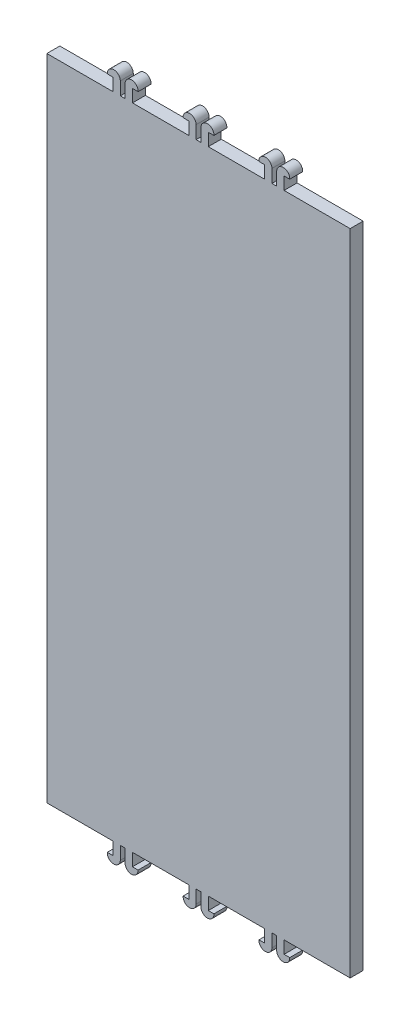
from build123d import *

# Parameters (mm, degrees)
BOSS_EXTRUDE1_DEPTH = 3


with BuildPart() as part:
    # Sketch1 → Boss-Extrude1 (new body)
    with BuildSketch(Plane.XY):
        with BuildLine():
            Line((35.05, -112.5), (35.05, 37.5))
            Line((35.05, 37.5), (19.774, 37.5))
            Line((19.774, 37.5), (19.774, 40.4))
            Line((19.774, 40.4), (21.07867185, 40.4))
            ThreePointArc((21.07867185, 40.4), (19.628027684, 42.003167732), (18.074, 40.5))
            Line((18.074, 40.5), (18.074, 37.5))
            Line((18.074, 37.5), (16.966, 37.5))
            Line((16.966, 37.5), (16.966, 40.5))
            ThreePointArc((16.966, 40.5), (15.411972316, 42.003167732), (13.96132815, 40.4))
            Line((13.96132815, 40.4), (15.266, 40.4))
            Line((15.266, 40.4), (15.266, 37.5))
            Line((15.266, 37.5), (2.254, 37.5))
            Line((2.254, 37.5), (2.254, 40.4))
            Line((2.254, 40.4), (3.55867185, 40.4))
            ThreePointArc((3.55867185, 40.4), (2.108027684, 42.003167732), (0.554, 40.5))
            Line((0.554, 40.5), (0.554, 37.5))
            Line((0.554, 37.5), (-0.554, 37.5))
            Line((-0.554, 37.5), (-0.554, 40.5))
            ThreePointArc((-0.554, 40.5), (-2.108027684, 42.003167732), (-3.55867185, 40.4))
            Line((-3.55867185, 40.4), (-2.254, 40.4))
            Line((-2.254, 40.4), (-2.254, 37.5))
            Line((-2.254, 37.5), (-15.271, 37.5))
            Line((-15.271, 37.5), (-15.271, 40.4))
            Line((-15.271, 40.4), (-13.96632815, 40.4))
            ThreePointArc((-13.96632815, 40.4), (-15.416972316, 42.003167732), (-16.971, 40.5))
            Line((-16.971, 40.5), (-16.971, 37.5))
            Line((-16.971, 37.5), (-18.079, 37.5))
            Line((-18.079, 37.5), (-18.079, 40.5))
            ThreePointArc((-18.079, 40.5), (-19.633027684, 42.003167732), (-21.08367185, 40.4))
            Line((-21.08367185, 40.4), (-19.779, 40.4))
            Line((-19.779, 40.4), (-19.779, 37.5))
            Line((-19.779, 37.5), (-35.05, 37.5))
            Line((-35.05, 37.5), (-35.05, -112.5))
            Line((-35.05, -112.5), (-19.779, -112.5))
            Line((-19.779, -112.5), (-19.779, -115.4))
            Line((-19.779, -115.4), (-21.08367185, -115.4))
            ThreePointArc((-21.08367185, -115.4), (-19.633027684, -117.003167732), (-18.079, -115.5))
            Line((-18.079, -115.5), (-18.079, -112.5))
            Line((-18.079, -112.5), (-16.971, -112.5))
            Line((-16.971, -112.5), (-16.971, -115.5))
            ThreePointArc((-16.971, -115.5), (-15.416972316, -117.003167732), (-13.96632815, -115.4))
            Line((-13.96632815, -115.4), (-15.271, -115.4))
            Line((-15.271, -115.4), (-15.271, -112.5))
            Line((-15.271, -112.5), (-2.254, -112.5))
            Line((-2.254, -112.5), (-2.254, -115.4))
            Line((-2.254, -115.4), (-3.55867185, -115.4))
            ThreePointArc((-3.55867185, -115.4), (-2.108027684, -117.003167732), (-0.554, -115.5))
            Line((-0.554, -115.5), (-0.554, -112.5))
            Line((-0.554, -112.5), (0.554, -112.5))
            Line((0.554, -112.5), (0.554, -115.5))
            ThreePointArc((0.554, -115.5), (2.108027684, -117.003167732), (3.55867185, -115.4))
            Line((3.55867185, -115.4), (2.254, -115.4))
            Line((2.254, -115.4), (2.254, -112.5))
            Line((2.254, -112.5), (15.266, -112.5))
            Line((15.266, -112.5), (15.266, -115.4))
            Line((15.266, -115.4), (13.96132815, -115.4))
            ThreePointArc((13.96132815, -115.4), (15.411972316, -117.003167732), (16.966, -115.5))
            Line((16.966, -115.5), (16.966, -112.5))
            Line((16.966, -112.5), (18.074, -112.5))
            Line((18.074, -112.5), (18.074, -115.5))
            ThreePointArc((18.074, -115.5), (19.628027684, -117.003167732), (21.07867185, -115.4))
            Line((21.07867185, -115.4), (19.774, -115.4))
            Line((19.774, -115.4), (19.774, -112.5))
            Line((19.774, -112.5), (35.05, -112.5))
        make_face()
    extrude(amount=BOSS_EXTRUDE1_DEPTH)


solid = part.part
